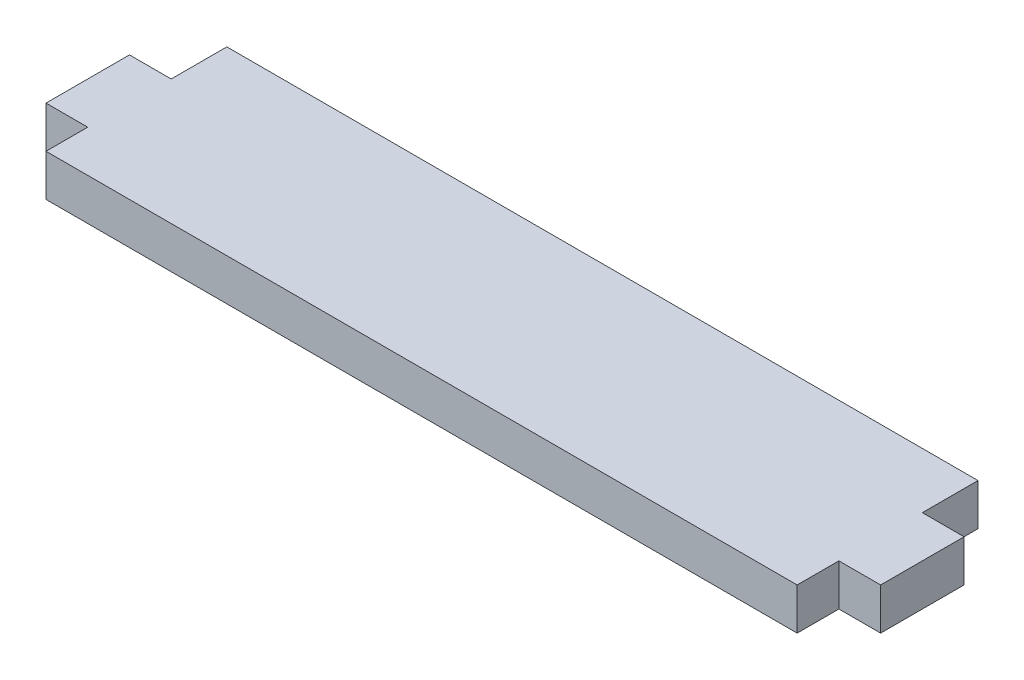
from build123d import *

# Parameters (mm, degrees)
SKETCH1_W           = 54
SKETCH1_H           = 13
BOSS_EXTRUDE1_DEPTH = 3
SKETCH2_W           = 3
SKETCH2_H           = 6
BOSS_EXTRUDE2_DEPTH = 3


with BuildPart() as part:
    # Sketch1 → Boss-Extrude1 (new body)
    with BuildSketch(Plane(origin=(0, 0, 0), x_dir=(1, 0, 0), z_dir=(0, 1, 0))):
        Rectangle(SKETCH1_W, SKETCH1_H)
    extrude(amount=BOSS_EXTRUDE1_DEPTH)

    # Sketch2 → Boss-Extrude2 (add)
    with BuildSketch(Plane(origin=(0, 0, 0), x_dir=(1, 0, 0), z_dir=(0, 1, 0))):
        with Locations((-28.5, -0.5)):
            Rectangle(SKETCH2_W, SKETCH2_H)
        with Locations((28.5, -0.5)):
            Rectangle(SKETCH2_W, SKETCH2_H)
    extrude(amount=BOSS_EXTRUDE2_DEPTH)


solid = part.part
